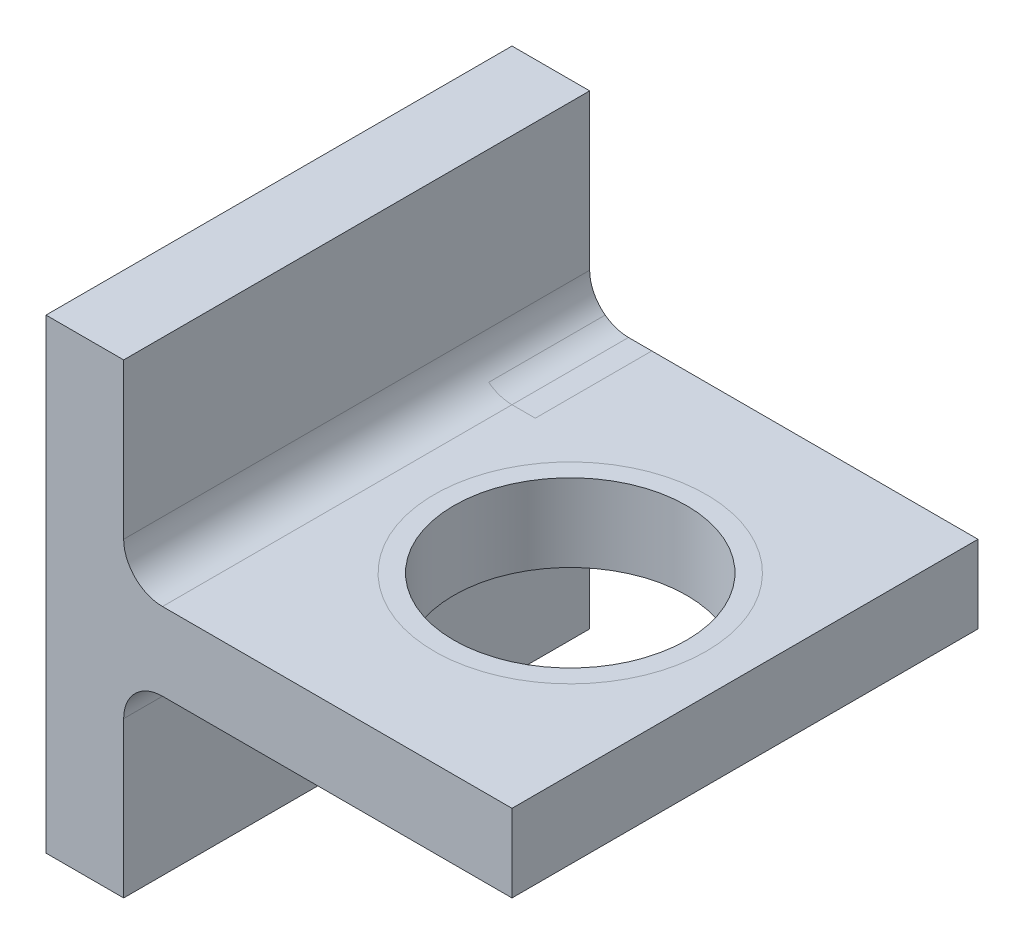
ISO-10303-21;
HEADER;
FILE_DESCRIPTION(('STEP AP214'),'2;1');
FILE_NAME('part.step','',(''),(''),'','','');
FILE_SCHEMA(('AUTOMOTIVE_DESIGN { 1 0 10303 214 1 1 1 1 }'));
ENDSEC;
DATA;
#1=APPLICATION_CONTEXT('core data for automotive mechanical design processes');
#2=APPLICATION_PROTOCOL_DEFINITION('international standard','automotive_design',2000,#1);
#3=PRODUCT_CONTEXT('',#1,'mechanical');
#4=PRODUCT('Part','Part','',(#3));
#5=PRODUCT_RELATED_PRODUCT_CATEGORY('part','',(#4));
#6=PRODUCT_DEFINITION_FORMATION('','',#4);
#7=PRODUCT_DEFINITION_CONTEXT('part definition',#1,'design');
#8=PRODUCT_DEFINITION('design','',#6,#7);
#9=PRODUCT_DEFINITION_SHAPE('','',#8);
#10=(LENGTH_UNIT() NAMED_UNIT(*) SI_UNIT(.MILLI.,.METRE.));
#11=(NAMED_UNIT(*) PLANE_ANGLE_UNIT() SI_UNIT($,.RADIAN.));
#12=(NAMED_UNIT(*) SI_UNIT($,.STERADIAN.) SOLID_ANGLE_UNIT());
#13=UNCERTAINTY_MEASURE_WITH_UNIT(LENGTH_MEASURE(1.E-05),#10,'distance_accuracy_value','');
#14=(GEOMETRIC_REPRESENTATION_CONTEXT(3) GLOBAL_UNCERTAINTY_ASSIGNED_CONTEXT((#13)) GLOBAL_UNIT_ASSIGNED_CONTEXT((#10,
#11,#12)) REPRESENTATION_CONTEXT('',''));
#15=CARTESIAN_POINT('',(0.,0.,0.));
#16=DIRECTION('',(0.,0.,1.));
#17=DIRECTION('',(1.,0.,0.));
#18=AXIS2_PLACEMENT_3D('',#15,#16,#17);
#19=CARTESIAN_POINT('',(20.,-10.,60.));
#20=DIRECTION('',(0.,1.,0.));
#21=DIRECTION('',(-1.,0.,0.));
#22=AXIS2_PLACEMENT_3D('',#19,#20,#21);
#23=PLANE('',#22);
#24=CARTESIAN_POINT('',(75.,-10.,0.));
#25=DIRECTION('',(0.,1.,0.));
#26=DIRECTION('',(-1.,0.,0.));
#27=AXIS2_PLACEMENT_3D('',#24,#25,#26);
#28=CIRCLE('',#27,35.);
#29=CARTESIAN_POINT('',(40.,-10.,0.));
#30=VERTEX_POINT('',#29);
#31=EDGE_CURVE('E200',#30,#30,#28,.F.);
#32=ORIENTED_EDGE('',*,*,#31,.F.);
#33=EDGE_LOOP('',(#32));
#34=FACE_BOUND('',#33,.T.);
#35=DIRECTION('',(-1.,0.,0.));
#36=VECTOR('',#35,1.);
#37=CARTESIAN_POINT('',(20.,-10.,-30.));
#38=LINE('',#37,#36);
#39=CARTESIAN_POINT('',(36.,-10.,-30.));
#40=VERTEX_POINT('',#39);
#41=CARTESIAN_POINT('',(30.,-10.,-30.));
#42=VERTEX_POINT('',#41);
#43=EDGE_CURVE('E11',#40,#42,#38,.T.);
#44=ORIENTED_EDGE('',*,*,#43,.F.);
#45=DIRECTION('',(0.,0.,1.));
#46=VECTOR('',#45,1.);
#47=CARTESIAN_POINT('',(36.,-10.,60.));
#48=LINE('',#47,#46);
#49=CARTESIAN_POINT('',(36.,-10.,-60.));
#50=VERTEX_POINT('',#49);
#51=EDGE_CURVE('E45',#50,#40,#48,.T.);
#52=ORIENTED_EDGE('',*,*,#51,.F.);
#53=DIRECTION('',(1.,0.,0.));
#54=VECTOR('',#53,1.);
#55=CARTESIAN_POINT('',(20.,-10.,-60.));
#56=LINE('',#55,#54);
#57=CARTESIAN_POINT('',(120.,-10.,-60.));
#58=VERTEX_POINT('',#57);
#59=EDGE_CURVE('E271',#50,#58,#56,.T.);
#60=ORIENTED_EDGE('',*,*,#59,.T.);
#61=DIRECTION('',(0.,0.,-1.));
#62=VECTOR('',#61,1.);
#63=CARTESIAN_POINT('',(120.,-10.,60.));
#64=LINE('',#63,#62);
#65=CARTESIAN_POINT('',(120.,-10.,60.));
#66=VERTEX_POINT('',#65);
#67=EDGE_CURVE('E170',#66,#58,#64,.T.);
#68=ORIENTED_EDGE('',*,*,#67,.F.);
#69=DIRECTION('',(1.,0.,0.));
#70=VECTOR('',#69,1.);
#71=CARTESIAN_POINT('',(20.,-10.,60.));
#72=LINE('',#71,#70);
#73=CARTESIAN_POINT('',(30.,-10.,60.));
#74=VERTEX_POINT('',#73);
#75=EDGE_CURVE('E289',#74,#66,#72,.T.);
#76=ORIENTED_EDGE('',*,*,#75,.F.);
#77=DIRECTION('',(0.,0.,-1.));
#78=VECTOR('',#77,1.);
#79=CARTESIAN_POINT('',(30.,-10.,-60.));
#80=LINE('',#79,#78);
#81=EDGE_CURVE('E168',#74,#42,#80,.T.);
#82=ORIENTED_EDGE('',*,*,#81,.T.);
#83=EDGE_LOOP('',(#44,#52,#60,#68,#76,#82));
#84=FACE_BOUND('',#83,.T.);
#85=ADVANCED_FACE('F35',(#34,#84),#23,.F.);
#86=CARTESIAN_POINT('',(30.,-20.,60.));
#87=DIRECTION('',(0.,0.,1.));
#88=DIRECTION('',(1.,0.,0.));
#89=AXIS2_PLACEMENT_3D('',#86,#87,#88);
#90=CYLINDRICAL_SURFACE('',#89,10.);
#91=DIRECTION('',(0.,0.,1.));
#92=VECTOR('',#91,1.);
#93=CARTESIAN_POINT('',(24.,-12.,60.));
#94=LINE('',#93,#92);
#95=CARTESIAN_POINT('',(24.,-12.,-30.));
#96=VERTEX_POINT('',#95);
#97=CARTESIAN_POINT('',(24.,-12.,-60.));
#98=VERTEX_POINT('',#97);
#99=EDGE_CURVE('E219',#96,#98,#94,.F.);
#100=ORIENTED_EDGE('',*,*,#99,.F.);
#101=CARTESIAN_POINT('',(30.,-20.,-30.));
#102=DIRECTION('',(0.,0.,-1.));
#103=DIRECTION('',(-1.,0.,0.));
#104=AXIS2_PLACEMENT_3D('',#101,#102,#103);
#105=CIRCLE('',#104,10.);
#106=EDGE_CURVE('E221',#42,#96,#105,.F.);
#107=ORIENTED_EDGE('',*,*,#106,.F.);
#108=ORIENTED_EDGE('',*,*,#81,.F.);
#109=CARTESIAN_POINT('',(30.,-20.,60.));
#110=DIRECTION('',(0.,0.,-1.));
#111=DIRECTION('',(-1.,0.,0.));
#112=AXIS2_PLACEMENT_3D('',#109,#110,#111);
#113=CIRCLE('',#112,10.);
#114=CARTESIAN_POINT('',(20.,-20.,60.));
#115=VERTEX_POINT('',#114);
#116=EDGE_CURVE('E187',#115,#74,#113,.T.);
#117=ORIENTED_EDGE('',*,*,#116,.F.);
#118=DIRECTION('',(0.,0.,-1.));
#119=VECTOR('',#118,1.);
#120=CARTESIAN_POINT('',(20.,-20.,60.));
#121=LINE('',#120,#119);
#122=CARTESIAN_POINT('',(20.,-20.,-60.));
#123=VERTEX_POINT('',#122);
#124=EDGE_CURVE('E174',#123,#115,#121,.F.);
#125=ORIENTED_EDGE('',*,*,#124,.F.);
#126=CARTESIAN_POINT('',(30.,-20.,-60.));
#127=DIRECTION('',(0.,0.,-1.));
#128=DIRECTION('',(-1.,0.,0.));
#129=AXIS2_PLACEMENT_3D('',#126,#127,#128);
#130=CIRCLE('',#129,10.);
#131=EDGE_CURVE('E183',#98,#123,#130,.F.);
#132=ORIENTED_EDGE('',*,*,#131,.F.);
#133=EDGE_LOOP('',(#100,#107,#108,#117,#125,#132));
#134=FACE_BOUND('',#133,.T.);
#135=ADVANCED_FACE('F310',(#134),#90,.F.);
#136=CARTESIAN_POINT('',(20.,10.,60.));
#137=DIRECTION('',(0.,-1.,0.));
#138=DIRECTION('',(1.,0.,0.));
#139=AXIS2_PLACEMENT_3D('',#136,#137,#138);
#140=PLANE('',#139);
#141=CARTESIAN_POINT('',(75.,10.,0.));
#142=DIRECTION('',(0.,-1.,0.));
#143=DIRECTION('',(1.,0.,0.));
#144=AXIS2_PLACEMENT_3D('',#141,#142,#143);
#145=CIRCLE('',#144,35.);
#146=CARTESIAN_POINT('',(110.,10.,0.));
#147=VERTEX_POINT('',#146);
#148=EDGE_CURVE('E195',#147,#147,#145,.F.);
#149=ORIENTED_EDGE('',*,*,#148,.F.);
#150=EDGE_LOOP('',(#149));
#151=FACE_BOUND('',#150,.T.);
#152=DIRECTION('',(1.,0.,0.));
#153=VECTOR('',#152,1.);
#154=CARTESIAN_POINT('',(20.,10.,-30.));
#155=LINE('',#154,#153);
#156=CARTESIAN_POINT('',(30.,10.,-30.));
#157=VERTEX_POINT('',#156);
#158=CARTESIAN_POINT('',(36.,10.,-30.));
#159=VERTEX_POINT('',#158);
#160=EDGE_CURVE('E39',#157,#159,#155,.T.);
#161=ORIENTED_EDGE('',*,*,#160,.F.);
#162=DIRECTION('',(0.,0.,-1.));
#163=VECTOR('',#162,1.);
#164=CARTESIAN_POINT('',(30.,10.,60.));
#165=LINE('',#164,#163);
#166=CARTESIAN_POINT('',(30.,10.,60.));
#167=VERTEX_POINT('',#166);
#168=EDGE_CURVE('E179',#157,#167,#165,.F.);
#169=ORIENTED_EDGE('',*,*,#168,.T.);
#170=DIRECTION('',(-1.,0.,0.));
#171=VECTOR('',#170,1.);
#172=CARTESIAN_POINT('',(20.,10.,60.));
#173=LINE('',#172,#171);
#174=CARTESIAN_POINT('',(120.,10.,60.));
#175=VERTEX_POINT('',#174);
#176=EDGE_CURVE('E285',#175,#167,#173,.T.);
#177=ORIENTED_EDGE('',*,*,#176,.F.);
#178=DIRECTION('',(0.,0.,-1.));
#179=VECTOR('',#178,1.);
#180=CARTESIAN_POINT('',(120.,10.,60.));
#181=LINE('',#180,#179);
#182=CARTESIAN_POINT('',(120.,10.,-60.));
#183=VERTEX_POINT('',#182);
#184=EDGE_CURVE('E245',#175,#183,#181,.T.);
#185=ORIENTED_EDGE('',*,*,#184,.T.);
#186=DIRECTION('',(-1.,0.,0.));
#187=VECTOR('',#186,1.);
#188=CARTESIAN_POINT('',(20.,10.,-60.));
#189=LINE('',#188,#187);
#190=CARTESIAN_POINT('',(36.,10.,-60.));
#191=VERTEX_POINT('',#190);
#192=EDGE_CURVE('E242',#183,#191,#189,.T.);
#193=ORIENTED_EDGE('',*,*,#192,.T.);
#194=DIRECTION('',(0.,0.,-1.));
#195=VECTOR('',#194,1.);
#196=CARTESIAN_POINT('',(36.,10.,60.));
#197=LINE('',#196,#195);
#198=EDGE_CURVE('E214',#159,#191,#197,.T.);
#199=ORIENTED_EDGE('',*,*,#198,.F.);
#200=EDGE_LOOP('',(#161,#169,#177,#185,#193,#199));
#201=FACE_BOUND('',#200,.T.);
#202=ADVANCED_FACE('F239',(#151,#201),#140,.F.);
#203=CARTESIAN_POINT('',(30.,20.,60.));
#204=DIRECTION('',(0.,0.,1.));
#205=DIRECTION('',(1.,0.,0.));
#206=AXIS2_PLACEMENT_3D('',#203,#204,#205);
#207=CYLINDRICAL_SURFACE('',#206,10.);
#208=DIRECTION('',(0.,0.,1.));
#209=VECTOR('',#208,1.);
#210=CARTESIAN_POINT('',(24.,12.,60.));
#211=LINE('',#210,#209);
#212=CARTESIAN_POINT('',(24.,12.,-60.));
#213=VERTEX_POINT('',#212);
#214=CARTESIAN_POINT('',(24.,12.,-30.));
#215=VERTEX_POINT('',#214);
#216=EDGE_CURVE('E211',#213,#215,#211,.T.);
#217=ORIENTED_EDGE('',*,*,#216,.F.);
#218=CARTESIAN_POINT('',(30.,20.,-60.));
#219=DIRECTION('',(0.,0.,-1.));
#220=DIRECTION('',(-1.,0.,0.));
#221=AXIS2_PLACEMENT_3D('',#218,#219,#220);
#222=CIRCLE('',#221,10.);
#223=CARTESIAN_POINT('',(20.,20.,-60.));
#224=VERTEX_POINT('',#223);
#225=EDGE_CURVE('E190',#224,#213,#222,.F.);
#226=ORIENTED_EDGE('',*,*,#225,.F.);
#227=DIRECTION('',(0.,0.,-1.));
#228=VECTOR('',#227,1.);
#229=CARTESIAN_POINT('',(20.,20.,-60.));
#230=LINE('',#229,#228);
#231=CARTESIAN_POINT('',(20.,20.,60.));
#232=VERTEX_POINT('',#231);
#233=EDGE_CURVE('E176',#232,#224,#230,.T.);
#234=ORIENTED_EDGE('',*,*,#233,.F.);
#235=CARTESIAN_POINT('',(30.,20.,60.));
#236=DIRECTION('',(0.,0.,-1.));
#237=DIRECTION('',(-1.,0.,0.));
#238=AXIS2_PLACEMENT_3D('',#235,#236,#237);
#239=CIRCLE('',#238,10.);
#240=EDGE_CURVE('E193',#167,#232,#239,.T.);
#241=ORIENTED_EDGE('',*,*,#240,.F.);
#242=ORIENTED_EDGE('',*,*,#168,.F.);
#243=CARTESIAN_POINT('',(30.,20.,-30.));
#244=DIRECTION('',(0.,0.,-1.));
#245=DIRECTION('',(-1.,0.,0.));
#246=AXIS2_PLACEMENT_3D('',#243,#244,#245);
#247=CIRCLE('',#246,10.);
#248=EDGE_CURVE('E204',#215,#157,#247,.F.);
#249=ORIENTED_EDGE('',*,*,#248,.F.);
#250=EDGE_LOOP('',(#217,#226,#234,#241,#242,#249));
#251=FACE_BOUND('',#250,.T.);
#252=ADVANCED_FACE('F306',(#251),#207,.F.);
#253=ORIENTED_EDGE('',*,*,#51,.T.);
#254=ORIENTED_EDGE('',*,*,#43,.T.);
#255=CARTESIAN_POINT('',(30.,-10.,-60.));
#256=VERTEX_POINT('',#255);
#257=EDGE_CURVE('E166',#42,#256,#80,.T.);
#258=ORIENTED_EDGE('',*,*,#257,.T.);
#259=EDGE_CURVE('E273',#256,#50,#56,.T.);
#260=ORIENTED_EDGE('',*,*,#259,.T.);
#261=EDGE_LOOP('',(#253,#254,#258,#260));
#262=FACE_BOUND('',#261,.T.);
#263=ADVANCED_FACE('F313',(#262),#23,.F.);
#264=CARTESIAN_POINT('',(30.,10.,-60.));
#265=VERTEX_POINT('',#264);
#266=EDGE_CURVE('E180',#265,#157,#165,.F.);
#267=ORIENTED_EDGE('',*,*,#266,.T.);
#268=ORIENTED_EDGE('',*,*,#160,.T.);
#269=ORIENTED_EDGE('',*,*,#198,.T.);
#270=EDGE_CURVE('E249',#191,#265,#189,.T.);
#271=ORIENTED_EDGE('',*,*,#270,.T.);
#272=EDGE_LOOP('',(#267,#268,#269,#271));
#273=FACE_BOUND('',#272,.T.);
#274=ADVANCED_FACE('F234',(#273),#140,.F.);
#275=CARTESIAN_POINT('',(0.,-60.,60.));
#276=DIRECTION('',(1.,0.,0.));
#277=DIRECTION('',(0.,0.,-1.));
#278=AXIS2_PLACEMENT_3D('',#275,#276,#277);
#279=PLANE('',#278);
#280=DIRECTION('',(0.,-1.,0.));
#281=VECTOR('',#280,1.);
#282=CARTESIAN_POINT('',(0.,-60.,-60.));
#283=LINE('',#282,#281);
#284=CARTESIAN_POINT('',(0.,60.,-60.));
#285=VERTEX_POINT('',#284);
#286=CARTESIAN_POINT('',(0.,-60.,-60.));
#287=VERTEX_POINT('',#286);
#288=EDGE_CURVE('E165',#285,#287,#283,.T.);
#289=ORIENTED_EDGE('',*,*,#288,.T.);
#290=DIRECTION('',(0.,0.,-1.));
#291=VECTOR('',#290,1.);
#292=CARTESIAN_POINT('',(0.,-60.,60.));
#293=LINE('',#292,#291);
#294=CARTESIAN_POINT('',(0.,-60.,60.));
#295=VERTEX_POINT('',#294);
#296=EDGE_CURVE('E144',#295,#287,#293,.T.);
#297=ORIENTED_EDGE('',*,*,#296,.F.);
#298=DIRECTION('',(0.,-1.,0.));
#299=VECTOR('',#298,1.);
#300=CARTESIAN_POINT('',(0.,-60.,60.));
#301=LINE('',#300,#299);
#302=CARTESIAN_POINT('',(0.,60.,60.));
#303=VERTEX_POINT('',#302);
#304=EDGE_CURVE('E152',#303,#295,#301,.T.);
#305=ORIENTED_EDGE('',*,*,#304,.F.);
#306=DIRECTION('',(0.,0.,-1.));
#307=VECTOR('',#306,1.);
#308=CARTESIAN_POINT('',(0.,60.,60.));
#309=LINE('',#308,#307);
#310=EDGE_CURVE('E257',#303,#285,#309,.T.);
#311=ORIENTED_EDGE('',*,*,#310,.T.);
#312=EDGE_LOOP('',(#289,#297,#305,#311));
#313=FACE_BOUND('',#312,.T.);
#314=ADVANCED_FACE('F163',(#313),#279,.F.);
#315=CARTESIAN_POINT('',(0.,-60.,60.));
#316=DIRECTION('',(0.,1.,0.));
#317=DIRECTION('',(-1.,0.,0.));
#318=AXIS2_PLACEMENT_3D('',#315,#316,#317);
#319=PLANE('',#318);
#320=DIRECTION('',(1.,0.,0.));
#321=VECTOR('',#320,1.);
#322=CARTESIAN_POINT('',(0.,-60.,-60.));
#323=LINE('',#322,#321);
#324=CARTESIAN_POINT('',(20.,-60.,-60.));
#325=VERTEX_POINT('',#324);
#326=EDGE_CURVE('E279',#287,#325,#323,.T.);
#327=ORIENTED_EDGE('',*,*,#326,.T.);
#328=DIRECTION('',(0.,0.,-1.));
#329=VECTOR('',#328,1.);
#330=CARTESIAN_POINT('',(20.,-60.,60.));
#331=LINE('',#330,#329);
#332=CARTESIAN_POINT('',(20.,-60.,60.));
#333=VERTEX_POINT('',#332);
#334=EDGE_CURVE('E147',#333,#325,#331,.T.);
#335=ORIENTED_EDGE('',*,*,#334,.F.);
#336=DIRECTION('',(1.,0.,0.));
#337=VECTOR('',#336,1.);
#338=CARTESIAN_POINT('',(0.,-60.,60.));
#339=LINE('',#338,#337);
#340=EDGE_CURVE('E140',#295,#333,#339,.T.);
#341=ORIENTED_EDGE('',*,*,#340,.F.);
#342=ORIENTED_EDGE('',*,*,#296,.T.);
#343=EDGE_LOOP('',(#327,#335,#341,#342));
#344=FACE_BOUND('',#343,.T.);
#345=ADVANCED_FACE('F142',(#344),#319,.F.);
#346=CARTESIAN_POINT('',(20.,-60.,60.));
#347=DIRECTION('',(-1.,0.,0.));
#348=DIRECTION('',(0.,-1.,0.));
#349=AXIS2_PLACEMENT_3D('',#346,#347,#348);
#350=PLANE('',#349);
#351=DIRECTION('',(0.,1.,0.));
#352=VECTOR('',#351,1.);
#353=CARTESIAN_POINT('',(20.,-60.,-60.));
#354=LINE('',#353,#352);
#355=EDGE_CURVE('E275',#325,#123,#354,.T.);
#356=ORIENTED_EDGE('',*,*,#355,.T.);
#357=ORIENTED_EDGE('',*,*,#124,.T.);
#358=DIRECTION('',(0.,1.,0.));
#359=VECTOR('',#358,1.);
#360=CARTESIAN_POINT('',(20.,-60.,60.));
#361=LINE('',#360,#359);
#362=EDGE_CURVE('E151',#333,#115,#361,.T.);
#363=ORIENTED_EDGE('',*,*,#362,.F.);
#364=ORIENTED_EDGE('',*,*,#334,.T.);
#365=EDGE_LOOP('',(#356,#357,#363,#364));
#366=FACE_BOUND('',#365,.T.);
#367=ADVANCED_FACE('F323',(#366),#350,.F.);
#368=ORIENTED_EDGE('',*,*,#31,.T.);
#369=EDGE_LOOP('',(#368));
#370=FACE_BOUND('',#369,.T.);
#371=CARTESIAN_POINT('',(75.,-10.,0.));
#372=DIRECTION('',(0.,1.,0.));
#373=DIRECTION('',(-1.,0.,0.));
#374=AXIS2_PLACEMENT_3D('',#371,#372,#373);
#375=CIRCLE('',#374,30.);
#376=CARTESIAN_POINT('',(75.,-10.,30.));
#377=VERTEX_POINT('',#376);
#378=EDGE_CURVE('E199',#377,#377,#375,.T.);
#379=ORIENTED_EDGE('',*,*,#378,.T.);
#380=EDGE_LOOP('',(#379));
#381=FACE_BOUND('',#380,.T.);
#382=ADVANCED_FACE('F295',(#370,#381),#23,.F.);
#383=CARTESIAN_POINT('',(120.,10.,60.));
#384=DIRECTION('',(-1.,0.,0.));
#385=DIRECTION('',(0.,0.,1.));
#386=AXIS2_PLACEMENT_3D('',#383,#384,#385);
#387=PLANE('',#386);
#388=DIRECTION('',(0.,1.,0.));
#389=VECTOR('',#388,1.);
#390=CARTESIAN_POINT('',(120.,10.,-60.));
#391=LINE('',#390,#389);
#392=EDGE_CURVE('E252',#58,#183,#391,.T.);
#393=ORIENTED_EDGE('',*,*,#392,.T.);
#394=ORIENTED_EDGE('',*,*,#184,.F.);
#395=DIRECTION('',(0.,1.,0.));
#396=VECTOR('',#395,1.);
#397=CARTESIAN_POINT('',(120.,10.,60.));
#398=LINE('',#397,#396);
#399=EDGE_CURVE('E267',#66,#175,#398,.T.);
#400=ORIENTED_EDGE('',*,*,#399,.F.);
#401=ORIENTED_EDGE('',*,*,#67,.T.);
#402=EDGE_LOOP('',(#393,#394,#400,#401));
#403=FACE_BOUND('',#402,.T.);
#404=ADVANCED_FACE('F266',(#403),#387,.F.);
#405=ORIENTED_EDGE('',*,*,#148,.T.);
#406=EDGE_LOOP('',(#405));
#407=FACE_BOUND('',#406,.T.);
#408=CARTESIAN_POINT('',(75.,10.,0.));
#409=DIRECTION('',(0.,-1.,0.));
#410=DIRECTION('',(1.,0.,0.));
#411=AXIS2_PLACEMENT_3D('',#408,#409,#410);
#412=CIRCLE('',#411,30.);
#413=CARTESIAN_POINT('',(75.,10.,30.));
#414=VERTEX_POINT('',#413);
#415=EDGE_CURVE('E196',#414,#414,#412,.T.);
#416=ORIENTED_EDGE('',*,*,#415,.T.);
#417=EDGE_LOOP('',(#416));
#418=FACE_BOUND('',#417,.T.);
#419=ADVANCED_FACE('F329',(#407,#418),#140,.F.);
#420=CARTESIAN_POINT('',(20.,10.,60.));
#421=DIRECTION('',(-1.,0.,0.));
#422=DIRECTION('',(0.,-1.,0.));
#423=AXIS2_PLACEMENT_3D('',#420,#421,#422);
#424=PLANE('',#423);
#425=DIRECTION('',(0.,1.,0.));
#426=VECTOR('',#425,1.);
#427=CARTESIAN_POINT('',(20.,10.,60.));
#428=LINE('',#427,#426);
#429=CARTESIAN_POINT('',(20.,60.,60.));
#430=VERTEX_POINT('',#429);
#431=EDGE_CURVE('E283',#232,#430,#428,.T.);
#432=ORIENTED_EDGE('',*,*,#431,.F.);
#433=ORIENTED_EDGE('',*,*,#233,.T.);
#434=DIRECTION('',(0.,1.,0.));
#435=VECTOR('',#434,1.);
#436=CARTESIAN_POINT('',(20.,10.,-60.));
#437=LINE('',#436,#435);
#438=CARTESIAN_POINT('',(20.,60.,-60.));
#439=VERTEX_POINT('',#438);
#440=EDGE_CURVE('E248',#224,#439,#437,.T.);
#441=ORIENTED_EDGE('',*,*,#440,.T.);
#442=DIRECTION('',(0.,0.,-1.));
#443=VECTOR('',#442,1.);
#444=CARTESIAN_POINT('',(20.,60.,60.));
#445=LINE('',#444,#443);
#446=EDGE_CURVE('E259',#430,#439,#445,.T.);
#447=ORIENTED_EDGE('',*,*,#446,.F.);
#448=EDGE_LOOP('',(#432,#433,#441,#447));
#449=FACE_BOUND('',#448,.T.);
#450=ADVANCED_FACE('F349',(#449),#424,.F.);
#451=CARTESIAN_POINT('',(0.,60.,60.));
#452=DIRECTION('',(0.,-1.,0.));
#453=DIRECTION('',(0.,0.,-1.));
#454=AXIS2_PLACEMENT_3D('',#451,#452,#453);
#455=PLANE('',#454);
#456=DIRECTION('',(-1.,0.,0.));
#457=VECTOR('',#456,1.);
#458=CARTESIAN_POINT('',(0.,60.,-60.));
#459=LINE('',#458,#457);
#460=EDGE_CURVE('E161',#439,#285,#459,.T.);
#461=ORIENTED_EDGE('',*,*,#460,.T.);
#462=ORIENTED_EDGE('',*,*,#310,.F.);
#463=DIRECTION('',(-1.,0.,0.));
#464=VECTOR('',#463,1.);
#465=CARTESIAN_POINT('',(0.,60.,60.));
#466=LINE('',#465,#464);
#467=EDGE_CURVE('E157',#430,#303,#466,.T.);
#468=ORIENTED_EDGE('',*,*,#467,.F.);
#469=ORIENTED_EDGE('',*,*,#446,.T.);
#470=EDGE_LOOP('',(#461,#462,#468,#469));
#471=FACE_BOUND('',#470,.T.);
#472=ADVANCED_FACE('F345',(#471),#455,.F.);
#473=CARTESIAN_POINT('',(0.,60.,60.));
#474=DIRECTION('',(0.,0.,-1.));
#475=DIRECTION('',(-1.,0.,0.));
#476=AXIS2_PLACEMENT_3D('',#473,#474,#475);
#477=PLANE('',#476);
#478=ORIENTED_EDGE('',*,*,#304,.T.);
#479=ORIENTED_EDGE('',*,*,#340,.T.);
#480=ORIENTED_EDGE('',*,*,#362,.T.);
#481=ORIENTED_EDGE('',*,*,#116,.T.);
#482=ORIENTED_EDGE('',*,*,#75,.T.);
#483=ORIENTED_EDGE('',*,*,#399,.T.);
#484=ORIENTED_EDGE('',*,*,#176,.T.);
#485=ORIENTED_EDGE('',*,*,#240,.T.);
#486=ORIENTED_EDGE('',*,*,#431,.T.);
#487=ORIENTED_EDGE('',*,*,#467,.T.);
#488=EDGE_LOOP('',(#478,#479,#480,#481,#482,#483,#484,#485,#486,#487));
#489=FACE_BOUND('',#488,.T.);
#490=ADVANCED_FACE('F155',(#489),#477,.F.);
#491=CARTESIAN_POINT('',(0.,60.,-60.));
#492=DIRECTION('',(0.,0.,-1.));
#493=DIRECTION('',(-1.,0.,0.));
#494=AXIS2_PLACEMENT_3D('',#491,#492,#493);
#495=PLANE('',#494);
#496=ORIENTED_EDGE('',*,*,#288,.F.);
#497=ORIENTED_EDGE('',*,*,#460,.F.);
#498=ORIENTED_EDGE('',*,*,#440,.F.);
#499=ORIENTED_EDGE('',*,*,#225,.T.);
#500=EDGE_CURVE('E189',#213,#265,#222,.F.);
#501=ORIENTED_EDGE('',*,*,#500,.T.);
#502=ORIENTED_EDGE('',*,*,#270,.F.);
#503=ORIENTED_EDGE('',*,*,#192,.F.);
#504=ORIENTED_EDGE('',*,*,#392,.F.);
#505=ORIENTED_EDGE('',*,*,#59,.F.);
#506=ORIENTED_EDGE('',*,*,#259,.F.);
#507=EDGE_CURVE('E184',#256,#98,#130,.F.);
#508=ORIENTED_EDGE('',*,*,#507,.T.);
#509=ORIENTED_EDGE('',*,*,#131,.T.);
#510=ORIENTED_EDGE('',*,*,#355,.F.);
#511=ORIENTED_EDGE('',*,*,#326,.F.);
#512=EDGE_LOOP('',(#496,#497,#498,#499,#501,#502,#503,#504,#505,#506,#508,#509,#510,#511));
#513=FACE_BOUND('',#512,.T.);
#514=ADVANCED_FACE('F269',(#513),#495,.T.);
#515=ORIENTED_EDGE('',*,*,#106,.T.);
#516=ORIENTED_EDGE('',*,*,#99,.T.);
#517=ORIENTED_EDGE('',*,*,#507,.F.);
#518=ORIENTED_EDGE('',*,*,#257,.F.);
#519=EDGE_LOOP('',(#515,#516,#517,#518));
#520=FACE_BOUND('',#519,.T.);
#521=ADVANCED_FACE('F304',(#520),#90,.F.);
#522=ORIENTED_EDGE('',*,*,#500,.F.);
#523=ORIENTED_EDGE('',*,*,#216,.T.);
#524=ORIENTED_EDGE('',*,*,#248,.T.);
#525=ORIENTED_EDGE('',*,*,#266,.F.);
#526=EDGE_LOOP('',(#522,#523,#524,#525));
#527=FACE_BOUND('',#526,.T.);
#528=ADVANCED_FACE('F37',(#527),#207,.F.);
#529=CARTESIAN_POINT('',(75.,-60.,0.));
#530=DIRECTION('',(0.,1.,0.));
#531=DIRECTION('',(0.,0.,1.));
#532=AXIS2_PLACEMENT_3D('',#529,#530,#531);
#533=CYLINDRICAL_SURFACE('',#532,30.);
#534=CARTESIAN_POINT('',(75.,10.,30.));
#535=CARTESIAN_POINT('',(75.,9.79166666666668,30.));
#536=CARTESIAN_POINT('',(75.,9.58333333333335,30.));
#537=CARTESIAN_POINT('',(75.,9.16666666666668,30.));
#538=CARTESIAN_POINT('',(75.,8.95833333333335,30.));
#539=CARTESIAN_POINT('',(75.,8.54166666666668,30.));
#540=CARTESIAN_POINT('',(75.,8.33333333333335,30.));
#541=CARTESIAN_POINT('',(75.,7.91666666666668,30.));
#542=CARTESIAN_POINT('',(75.,7.70833333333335,30.));
#543=CARTESIAN_POINT('',(75.,7.29166666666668,30.));
#544=CARTESIAN_POINT('',(75.,7.08333333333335,30.));
#545=CARTESIAN_POINT('',(75.,6.66666666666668,30.));
#546=CARTESIAN_POINT('',(75.,6.45833333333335,30.));
#547=CARTESIAN_POINT('',(75.,6.04166666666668,30.));
#548=CARTESIAN_POINT('',(75.,5.83333333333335,30.));
#549=CARTESIAN_POINT('',(75.,5.41666666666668,30.));
#550=CARTESIAN_POINT('',(75.,5.20833333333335,30.));
#551=CARTESIAN_POINT('',(75.,4.79166666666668,30.));
#552=CARTESIAN_POINT('',(75.,4.58333333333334,30.));
#553=CARTESIAN_POINT('',(75.,4.16666666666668,30.));
#554=CARTESIAN_POINT('',(75.,3.95833333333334,30.));
#555=CARTESIAN_POINT('',(75.,3.54166666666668,30.));
#556=CARTESIAN_POINT('',(75.,3.33333333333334,30.));
#557=CARTESIAN_POINT('',(75.,2.91666666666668,30.));
#558=CARTESIAN_POINT('',(75.,2.70833333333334,30.));
#559=CARTESIAN_POINT('',(75.,2.29166666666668,30.));
#560=CARTESIAN_POINT('',(75.,2.08333333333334,30.));
#561=CARTESIAN_POINT('',(75.,1.66666666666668,30.));
#562=CARTESIAN_POINT('',(75.,1.45833333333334,30.));
#563=CARTESIAN_POINT('',(75.,1.04166666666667,30.));
#564=CARTESIAN_POINT('',(75.,0.833333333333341,30.));
#565=CARTESIAN_POINT('',(75.,0.416666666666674,30.));
#566=CARTESIAN_POINT('',(75.,0.20833333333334,30.));
#567=CARTESIAN_POINT('',(75.,-0.208333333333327,30.));
#568=CARTESIAN_POINT('',(75.,-0.41666666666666,30.));
#569=CARTESIAN_POINT('',(75.,-0.833333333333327,30.));
#570=CARTESIAN_POINT('',(75.,-1.04166666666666,30.));
#571=CARTESIAN_POINT('',(75.,-1.45833333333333,30.));
#572=CARTESIAN_POINT('',(75.,-1.66666666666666,30.));
#573=CARTESIAN_POINT('',(75.,-2.08333333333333,30.));
#574=CARTESIAN_POINT('',(75.,-2.29166666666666,30.));
#575=CARTESIAN_POINT('',(75.,-2.70833333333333,30.));
#576=CARTESIAN_POINT('',(75.,-2.91666666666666,30.));
#577=CARTESIAN_POINT('',(75.,-3.33333333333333,30.));
#578=CARTESIAN_POINT('',(75.,-3.54166666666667,30.));
#579=CARTESIAN_POINT('',(75.,-3.95833333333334,30.));
#580=CARTESIAN_POINT('',(75.,-4.16666666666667,30.));
#581=CARTESIAN_POINT('',(75.,-4.58333333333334,30.));
#582=CARTESIAN_POINT('',(75.,-4.79166666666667,30.));
#583=CARTESIAN_POINT('',(75.,-5.20833333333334,30.));
#584=CARTESIAN_POINT('',(75.,-5.41666666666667,30.));
#585=CARTESIAN_POINT('',(75.,-5.83333333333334,30.));
#586=CARTESIAN_POINT('',(75.,-6.04166666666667,30.));
#587=CARTESIAN_POINT('',(75.,-6.45833333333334,30.));
#588=CARTESIAN_POINT('',(75.,-6.66666666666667,30.));
#589=CARTESIAN_POINT('',(75.,-7.08333333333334,30.));
#590=CARTESIAN_POINT('',(75.,-7.29166666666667,30.));
#591=CARTESIAN_POINT('',(75.,-7.70833333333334,30.));
#592=CARTESIAN_POINT('',(75.,-7.91666666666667,30.));
#593=CARTESIAN_POINT('',(75.,-8.33333333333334,30.));
#594=CARTESIAN_POINT('',(75.,-8.54166666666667,30.));
#595=CARTESIAN_POINT('',(75.,-8.95833333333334,30.));
#596=CARTESIAN_POINT('',(75.,-9.16666666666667,30.));
#597=CARTESIAN_POINT('',(75.,-9.58333333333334,30.));
#598=CARTESIAN_POINT('',(75.,-9.79166666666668,30.));
#599=CARTESIAN_POINT('',(75.,-10.,30.));
#600=B_SPLINE_CURVE_WITH_KNOTS('',3,(#534,#535,#536,#537,#538,#539,#540,#541,#542,#543,#544,
#545,#546,#547,#548,#549,#550,#551,#552,#553,#554,#555,#556,#557,#558,#559,#560,#561,#562,#563,
#564,#565,#566,#567,#568,#569,#570,#571,#572,#573,#574,#575,#576,#577,#578,#579,#580,#581,#582,
#583,#584,#585,#586,#587,#588,#589,#590,#591,#592,#593,#594,#595,#596,#597,#598,#599),
.UNSPECIFIED.,.F.,.F.,(4,2,2,2,2,2,2,2,2,2,2,2,2,2,2,2,2,2,2,2,2,2,2,2,2,2,2,2,2,2,2,2,4),(0.,
0.625000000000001,1.25,1.875,2.5,3.125,3.75,4.375,5.,5.62500000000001,6.25000000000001,
6.87500000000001,7.50000000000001,8.12500000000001,8.75000000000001,9.37500000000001,10.,10.625,
11.25,11.875,12.5,13.125,13.75,14.375,15.,15.625,16.25,16.875,17.5,18.125,18.75,19.375,20.),.UNSPECIFIED.);
#601=EDGE_CURVE('BSEAM297',#414,#377,#600,.T.);
#602=ORIENTED_EDGE('',*,*,#415,.F.);
#603=ORIENTED_EDGE('',*,*,#378,.F.);
#604=ORIENTED_EDGE('',*,*,#601,.T.);
#605=ORIENTED_EDGE('',*,*,#601,.F.);
#606=EDGE_LOOP('',(#602,#604,#603,#605));
#607=FACE_BOUND('',#606,.T.);
#608=ADVANCED_FACE('F297',(#607),#533,.F.);
#609=CLOSED_SHELL('',(#85,#135,#202,#252,#263,#274,#314,#345,#367,#382,#404,#419,#450,#472,#490,
#514,#521,#528,#608));
#610=MANIFOLD_SOLID_BREP('B2',#609);
#611=ADVANCED_BREP_SHAPE_REPRESENTATION('',(#18,#610),#14);
#612=SHAPE_DEFINITION_REPRESENTATION(#9,#611);
ENDSEC;
END-ISO-10303-21;
